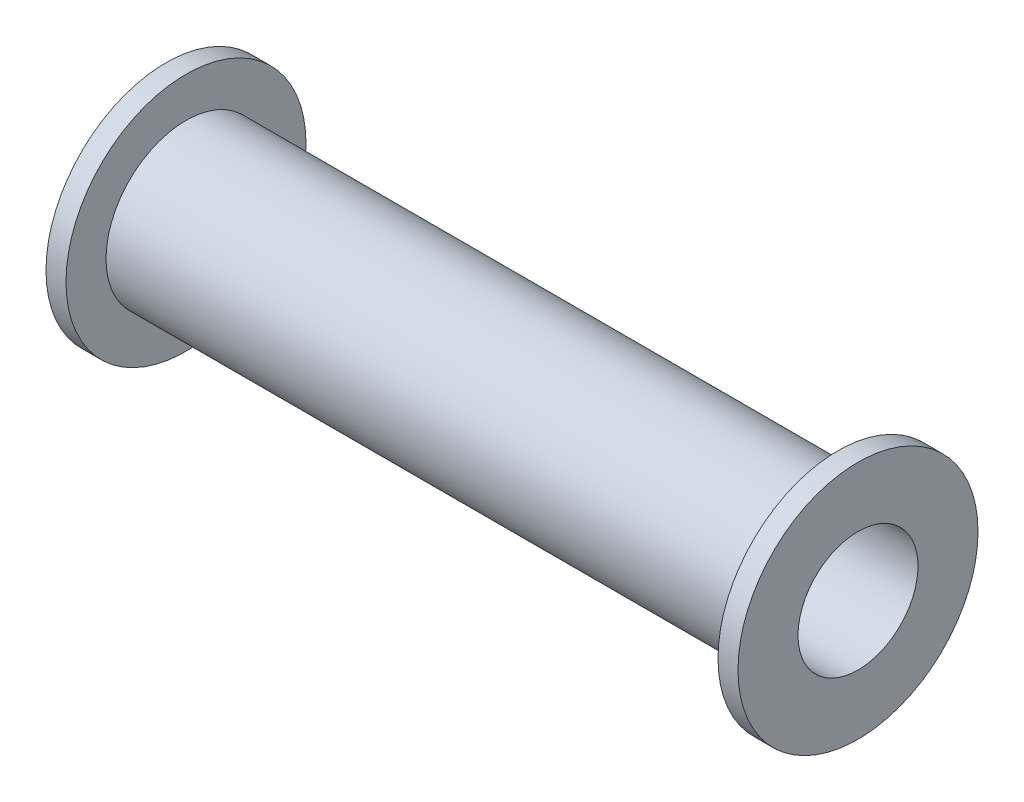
ISO-10303-21;
HEADER;
FILE_DESCRIPTION(('STEP AP214'),'2;1');
FILE_NAME('part.step','',(''),(''),'','','');
FILE_SCHEMA(('AUTOMOTIVE_DESIGN { 1 0 10303 214 1 1 1 1 }'));
ENDSEC;
DATA;
#1=APPLICATION_CONTEXT('core data for automotive mechanical design processes');
#2=APPLICATION_PROTOCOL_DEFINITION('international standard','automotive_design',2000,#1);
#3=PRODUCT_CONTEXT('',#1,'mechanical');
#4=PRODUCT('Part','Part','',(#3));
#5=PRODUCT_RELATED_PRODUCT_CATEGORY('part','',(#4));
#6=PRODUCT_DEFINITION_FORMATION('','',#4);
#7=PRODUCT_DEFINITION_CONTEXT('part definition',#1,'design');
#8=PRODUCT_DEFINITION('design','',#6,#7);
#9=PRODUCT_DEFINITION_SHAPE('','',#8);
#10=(LENGTH_UNIT() NAMED_UNIT(*) SI_UNIT(.MILLI.,.METRE.));
#11=(NAMED_UNIT(*) PLANE_ANGLE_UNIT() SI_UNIT($,.RADIAN.));
#12=(NAMED_UNIT(*) SI_UNIT($,.STERADIAN.) SOLID_ANGLE_UNIT());
#13=UNCERTAINTY_MEASURE_WITH_UNIT(LENGTH_MEASURE(1.E-05),#10,'distance_accuracy_value','');
#14=(GEOMETRIC_REPRESENTATION_CONTEXT(3) GLOBAL_UNCERTAINTY_ASSIGNED_CONTEXT((#13)) GLOBAL_UNIT_ASSIGNED_CONTEXT((#10,
#11,#12)) REPRESENTATION_CONTEXT('',''));
#15=CARTESIAN_POINT('',(0.,0.,0.));
#16=DIRECTION('',(0.,0.,1.));
#17=DIRECTION('',(1.,0.,0.));
#18=AXIS2_PLACEMENT_3D('',#15,#16,#17);
#19=CARTESIAN_POINT('',(17.3,1.49999999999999,0.));
#20=DIRECTION('',(-1.,0.,0.));
#21=DIRECTION('',(0.,0.,1.));
#22=AXIS2_PLACEMENT_3D('',#19,#20,#21);
#23=PLANE('',#22);
#24=CARTESIAN_POINT('',(17.3,0.,0.));
#25=DIRECTION('',(-1.,0.,0.));
#26=DIRECTION('',(0.,0.,1.));
#27=AXIS2_PLACEMENT_3D('',#24,#25,#26);
#28=CIRCLE('',#27,2.99999999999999);
#29=CARTESIAN_POINT('',(17.3,0.,2.99999999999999));
#30=VERTEX_POINT('',#29);
#31=EDGE_CURVE('E10',#30,#30,#28,.T.);
#32=ORIENTED_EDGE('',*,*,#31,.F.);
#33=EDGE_LOOP('',(#32));
#34=FACE_BOUND('',#33,.T.);
#35=CARTESIAN_POINT('',(17.3,0.,0.));
#36=DIRECTION('',(-1.,0.,0.));
#37=DIRECTION('',(0.,0.,1.));
#38=AXIS2_PLACEMENT_3D('',#35,#36,#37);
#39=CIRCLE('',#38,1.49999999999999);
#40=CARTESIAN_POINT('',(17.3,0.,1.49999999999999));
#41=VERTEX_POINT('',#40);
#42=EDGE_CURVE('E53',#41,#41,#39,.T.);
#43=ORIENTED_EDGE('',*,*,#42,.T.);
#44=EDGE_LOOP('',(#43));
#45=FACE_BOUND('',#44,.T.);
#46=ADVANCED_FACE('F25',(#34,#45),#23,.F.);
#47=CARTESIAN_POINT('',(0.,0.,0.));
#48=DIRECTION('',(-1.,0.,0.));
#49=DIRECTION('',(0.,0.,1.));
#50=AXIS2_PLACEMENT_3D('',#47,#48,#49);
#51=CYLINDRICAL_SURFACE('',#50,2.99999999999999);
#52=CARTESIAN_POINT('',(16.8,0.,0.));
#53=DIRECTION('',(-1.,0.,0.));
#54=DIRECTION('',(0.,0.,1.));
#55=AXIS2_PLACEMENT_3D('',#52,#53,#54);
#56=CIRCLE('',#55,2.99999999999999);
#57=CARTESIAN_POINT('',(16.8,0.,2.99999999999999));
#58=VERTEX_POINT('',#57);
#59=EDGE_CURVE('E31',#58,#58,#56,.T.);
#60=ORIENTED_EDGE('',*,*,#59,.F.);
#61=EDGE_LOOP('',(#60));
#62=FACE_BOUND('',#61,.T.);
#63=ORIENTED_EDGE('',*,*,#31,.T.);
#64=EDGE_LOOP('',(#63));
#65=FACE_BOUND('',#64,.T.);
#66=ADVANCED_FACE('F90',(#62,#65),#51,.T.);
#67=CARTESIAN_POINT('',(16.8,2.99999999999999,0.));
#68=DIRECTION('',(1.,0.,0.));
#69=DIRECTION('',(0.,0.,-1.));
#70=AXIS2_PLACEMENT_3D('',#67,#68,#69);
#71=PLANE('',#70);
#72=CARTESIAN_POINT('',(16.8,0.,0.));
#73=DIRECTION('',(-1.,0.,0.));
#74=DIRECTION('',(0.,0.,1.));
#75=AXIS2_PLACEMENT_3D('',#72,#73,#74);
#76=CIRCLE('',#75,1.99999999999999);
#77=CARTESIAN_POINT('',(16.8,0.,1.99999999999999));
#78=VERTEX_POINT('',#77);
#79=EDGE_CURVE('E35',#78,#78,#76,.T.);
#80=ORIENTED_EDGE('',*,*,#79,.F.);
#81=EDGE_LOOP('',(#80));
#82=FACE_BOUND('',#81,.T.);
#83=ORIENTED_EDGE('',*,*,#59,.T.);
#84=EDGE_LOOP('',(#83));
#85=FACE_BOUND('',#84,.T.);
#86=ADVANCED_FACE('F85',(#82,#85),#71,.F.);
#87=CARTESIAN_POINT('',(0.,0.,0.));
#88=DIRECTION('',(-1.,0.,0.));
#89=DIRECTION('',(0.,0.,1.));
#90=AXIS2_PLACEMENT_3D('',#87,#88,#89);
#91=CYLINDRICAL_SURFACE('',#90,1.99999999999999);
#92=CARTESIAN_POINT('',(0.5,0.,0.));
#93=DIRECTION('',(-1.,0.,0.));
#94=DIRECTION('',(0.,0.,1.));
#95=AXIS2_PLACEMENT_3D('',#92,#93,#94);
#96=CIRCLE('',#95,1.99999999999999);
#97=CARTESIAN_POINT('',(0.5,0.,1.99999999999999));
#98=VERTEX_POINT('',#97);
#99=EDGE_CURVE('E39',#98,#98,#96,.T.);
#100=ORIENTED_EDGE('',*,*,#99,.F.);
#101=EDGE_LOOP('',(#100));
#102=FACE_BOUND('',#101,.T.);
#103=ORIENTED_EDGE('',*,*,#79,.T.);
#104=EDGE_LOOP('',(#103));
#105=FACE_BOUND('',#104,.T.);
#106=ADVANCED_FACE('F79',(#102,#105),#91,.T.);
#107=CARTESIAN_POINT('',(0.5,1.99999999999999,0.));
#108=DIRECTION('',(-1.,0.,0.));
#109=DIRECTION('',(0.,0.,1.));
#110=AXIS2_PLACEMENT_3D('',#107,#108,#109);
#111=PLANE('',#110);
#112=CARTESIAN_POINT('',(0.5,0.,0.));
#113=DIRECTION('',(-1.,0.,0.));
#114=DIRECTION('',(0.,0.,1.));
#115=AXIS2_PLACEMENT_3D('',#112,#113,#114);
#116=CIRCLE('',#115,2.99999999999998);
#117=CARTESIAN_POINT('',(0.5,0.,2.99999999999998));
#118=VERTEX_POINT('',#117);
#119=EDGE_CURVE('E44',#118,#118,#116,.T.);
#120=ORIENTED_EDGE('',*,*,#119,.F.);
#121=EDGE_LOOP('',(#120));
#122=FACE_BOUND('',#121,.T.);
#123=ORIENTED_EDGE('',*,*,#99,.T.);
#124=EDGE_LOOP('',(#123));
#125=FACE_BOUND('',#124,.T.);
#126=ADVANCED_FACE('F73',(#122,#125),#111,.F.);
#127=CARTESIAN_POINT('',(0.,0.,0.));
#128=DIRECTION('',(-1.,0.,0.));
#129=DIRECTION('',(0.,0.,1.));
#130=AXIS2_PLACEMENT_3D('',#127,#128,#129);
#131=CYLINDRICAL_SURFACE('',#130,2.99999999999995);
#132=CARTESIAN_POINT('',(0.,0.,0.));
#133=DIRECTION('',(-1.,0.,0.));
#134=DIRECTION('',(0.,0.,1.));
#135=AXIS2_PLACEMENT_3D('',#132,#133,#134);
#136=CIRCLE('',#135,2.99999999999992);
#137=CARTESIAN_POINT('',(0.,0.,2.99999999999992));
#138=VERTEX_POINT('',#137);
#139=EDGE_CURVE('E47',#138,#138,#136,.T.);
#140=ORIENTED_EDGE('',*,*,#139,.F.);
#141=EDGE_LOOP('',(#140));
#142=FACE_BOUND('',#141,.T.);
#143=ORIENTED_EDGE('',*,*,#119,.T.);
#144=EDGE_LOOP('',(#143));
#145=FACE_BOUND('',#144,.T.);
#146=ADVANCED_FACE('F67',(#142,#145),#131,.T.);
#147=CARTESIAN_POINT('',(0.,2.99999999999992,0.));
#148=DIRECTION('',(1.,0.,0.));
#149=DIRECTION('',(0.,0.,-1.));
#150=AXIS2_PLACEMENT_3D('',#147,#148,#149);
#151=PLANE('',#150);
#152=CARTESIAN_POINT('',(0.,0.,0.));
#153=DIRECTION('',(-1.,0.,0.));
#154=DIRECTION('',(0.,0.,1.));
#155=AXIS2_PLACEMENT_3D('',#152,#153,#154);
#156=CIRCLE('',#155,1.49999999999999);
#157=CARTESIAN_POINT('',(0.,0.,1.49999999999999));
#158=VERTEX_POINT('',#157);
#159=EDGE_CURVE('E50',#158,#158,#156,.T.);
#160=ORIENTED_EDGE('',*,*,#159,.F.);
#161=EDGE_LOOP('',(#160));
#162=FACE_BOUND('',#161,.T.);
#163=ORIENTED_EDGE('',*,*,#139,.T.);
#164=EDGE_LOOP('',(#163));
#165=FACE_BOUND('',#164,.T.);
#166=ADVANCED_FACE('F61',(#162,#165),#151,.F.);
#167=CARTESIAN_POINT('',(0.,0.,0.));
#168=DIRECTION('',(-1.,0.,0.));
#169=DIRECTION('',(0.,0.,1.));
#170=AXIS2_PLACEMENT_3D('',#167,#168,#169);
#171=CYLINDRICAL_SURFACE('',#170,1.49999999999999);
#172=ORIENTED_EDGE('',*,*,#42,.F.);
#173=EDGE_LOOP('',(#172));
#174=FACE_BOUND('',#173,.T.);
#175=ORIENTED_EDGE('',*,*,#159,.T.);
#176=EDGE_LOOP('',(#175));
#177=FACE_BOUND('',#176,.T.);
#178=ADVANCED_FACE('F58',(#174,#177),#171,.F.);
#179=CLOSED_SHELL('',(#46,#66,#86,#106,#126,#146,#166,#178));
#180=MANIFOLD_SOLID_BREP('B2',#179);
#181=ADVANCED_BREP_SHAPE_REPRESENTATION('',(#18,#180),#14);
#182=SHAPE_DEFINITION_REPRESENTATION(#9,#181);
ENDSEC;
END-ISO-10303-21;
